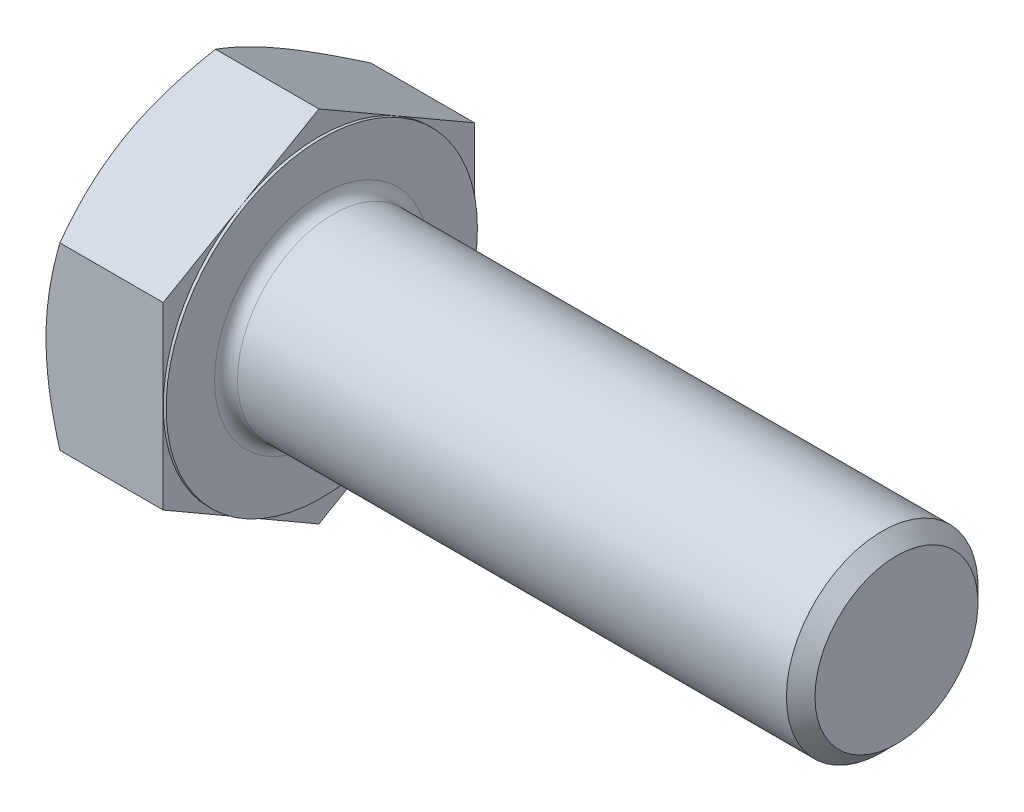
from build123d import *

# Parameters (mm, degrees)
BASEHEAD_DEPTH = 15.9258
SKETCH4_W      = 0.381
SKETCH4_H      = 28.592632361
HEADFILLET_R   = 1.524


with BuildPart() as part:
    # Sketch1 → BaseHead (new body)
    with BuildSketch(Plane(origin=(0, 0, 0), x_dir=(0, 0, -1), z_dir=(1, 0, 0))):
        Polygon((20.6375, 11.91506618), (20.6375, -11.91506618), (0, -23.830132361), (-20.6375, -11.91506618), (-20.6375, 11.91506618), (0, 23.830132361), align=None)
    extrude(amount=BASEHEAD_DEPTH)

    # BodySke → BaseBody (revolve)
    with BuildSketch(Plane.XY, mode=Mode.PRIVATE) as basebody_sk:
        Polygon((0, 0), (92.1258, 0), (92.1258, 10.8077), (90.2335, 12.7), (0, 12.7), align=None)
    revolve(basebody_sk.sketch.rotate(Axis((0, 0, 0), (1, 0, 0)), 90), axis=Axis((0, 0, 0), (1, 0, 0)))

    # Sketch3 → HeadChamfer (revolve, cut)
    with BuildSketch(Plane.XY):
        Polygon((0, 20.6375), (5.509441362, 30.180132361), (5.509441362, 36.530132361), (-12.7, 36.530132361), (-12.7, 20.6375), align=None)
    revolve(axis=Axis((0, 0, 0), (1, 0, 0)), mode=Mode.SUBTRACT)

    # Sketch4 → BearingFace (revolve, cut)
    with BuildSketch(Plane.XY, mode=Mode.PRIVATE) as bearingface_sk:
        with Locations((15.7353, 34.933816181)):
            Rectangle(SKETCH4_W, SKETCH4_H)
    revolve(bearingface_sk.sketch.rotate(Axis((0, 0, 0), (1, 0, 0)), 270), axis=Axis((0, 0, 0), (1, 0, 0)), mode=Mode.SUBTRACT)

    # HeadFillet
    headfillet_edges = [part.edges().sort_by_distance(p)[0] for p in [
        (15.9258, 0, -12.7),
    ]]
    fillet(headfillet_edges, radius=HEADFILLET_R)


solid = part.part
